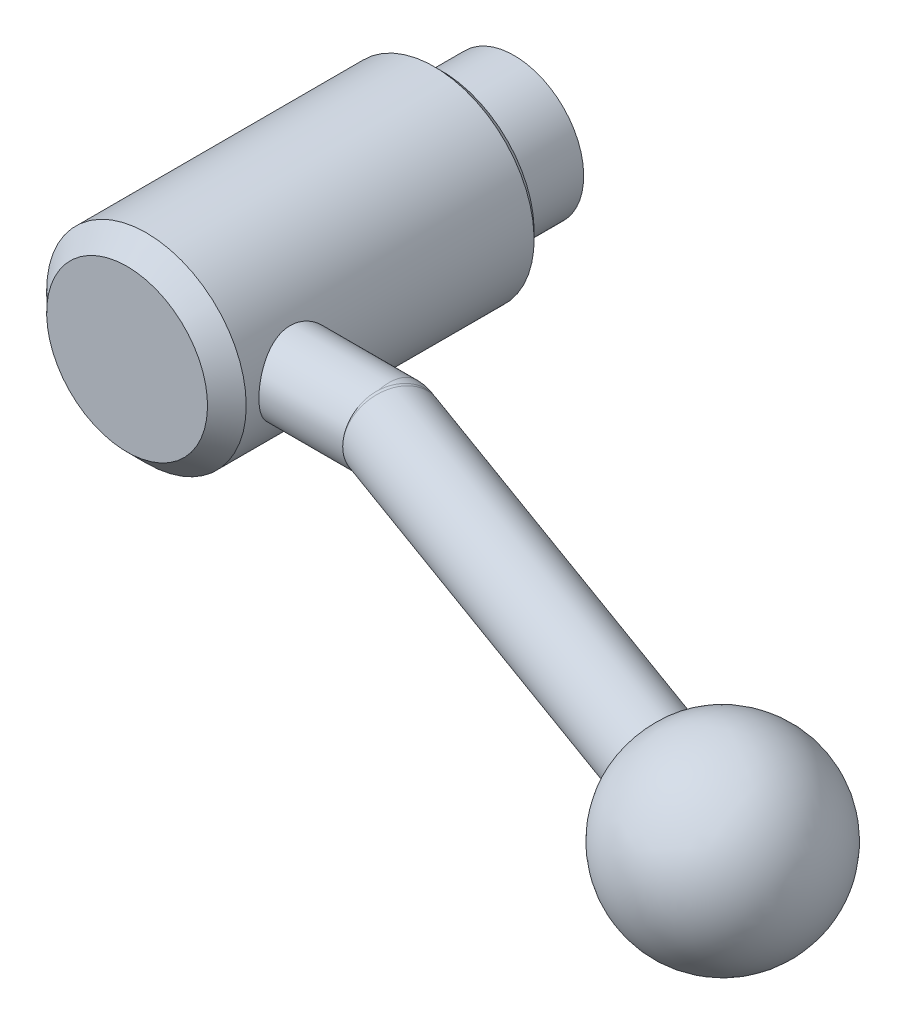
ISO-10303-21;
HEADER;
FILE_DESCRIPTION(('STEP AP214'),'2;1');
FILE_NAME('part.step','',(''),(''),'','','');
FILE_SCHEMA(('AUTOMOTIVE_DESIGN { 1 0 10303 214 1 1 1 1 }'));
ENDSEC;
DATA;
#1=APPLICATION_CONTEXT('core data for automotive mechanical design processes');
#2=APPLICATION_PROTOCOL_DEFINITION('international standard','automotive_design',2000,#1);
#3=PRODUCT_CONTEXT('',#1,'mechanical');
#4=PRODUCT('Part','Part','',(#3));
#5=PRODUCT_RELATED_PRODUCT_CATEGORY('part','',(#4));
#6=PRODUCT_DEFINITION_FORMATION('','',#4);
#7=PRODUCT_DEFINITION_CONTEXT('part definition',#1,'design');
#8=PRODUCT_DEFINITION('design','',#6,#7);
#9=PRODUCT_DEFINITION_SHAPE('','',#8);
#10=(LENGTH_UNIT() NAMED_UNIT(*) SI_UNIT(.MILLI.,.METRE.));
#11=(NAMED_UNIT(*) PLANE_ANGLE_UNIT() SI_UNIT($,.RADIAN.));
#12=(NAMED_UNIT(*) SI_UNIT($,.STERADIAN.) SOLID_ANGLE_UNIT());
#13=UNCERTAINTY_MEASURE_WITH_UNIT(LENGTH_MEASURE(1.E-05),#10,'distance_accuracy_value','');
#14=(GEOMETRIC_REPRESENTATION_CONTEXT(3) GLOBAL_UNCERTAINTY_ASSIGNED_CONTEXT((#13)) GLOBAL_UNIT_ASSIGNED_CONTEXT((#10,
#11,#12)) REPRESENTATION_CONTEXT('',''));
#15=CARTESIAN_POINT('',(0.,0.,0.));
#16=DIRECTION('',(0.,0.,1.));
#17=DIRECTION('',(1.,0.,0.));
#18=AXIS2_PLACEMENT_3D('',#15,#16,#17);
#19=CARTESIAN_POINT('',(5.75,0.,0.));
#20=DIRECTION('',(0.,0.,-1.));
#21=DIRECTION('',(0.,1.,0.));
#22=AXIS2_PLACEMENT_3D('',#19,#20,#21);
#23=PLANE('',#22);
#24=CARTESIAN_POINT('',(0.,0.,0.));
#25=DIRECTION('',(0.,0.,-1.));
#26=DIRECTION('',(-1.,0.,0.));
#27=AXIS2_PLACEMENT_3D('',#24,#25,#26);
#28=CIRCLE('',#27,9.);
#29=CARTESIAN_POINT('',(-9.,0.,0.));
#30=VERTEX_POINT('',#29);
#31=EDGE_CURVE('E9',#30,#30,#28,.F.);
#32=ORIENTED_EDGE('',*,*,#31,.T.);
#33=EDGE_LOOP('',(#32));
#34=FACE_BOUND('',#33,.T.);
#35=CARTESIAN_POINT('',(0.,0.,0.));
#36=DIRECTION('',(0.,0.,1.));
#37=DIRECTION('',(0.,-1.,0.));
#38=AXIS2_PLACEMENT_3D('',#35,#36,#37);
#39=CIRCLE('',#38,11.5);
#40=CARTESIAN_POINT('',(0.,-11.5,0.));
#41=VERTEX_POINT('',#40);
#42=EDGE_CURVE('E286',#41,#41,#39,.T.);
#43=ORIENTED_EDGE('',*,*,#42,.F.);
#44=EDGE_LOOP('',(#43));
#45=FACE_BOUND('',#44,.T.);
#46=ADVANCED_FACE('F14',(#34,#45),#23,.T.);
#47=CARTESIAN_POINT('',(0.,0.,6.));
#48=DIRECTION('',(0.,0.,1.));
#49=DIRECTION('',(0.,-1.,0.));
#50=AXIS2_PLACEMENT_3D('',#47,#48,#49);
#51=CYLINDRICAL_SURFACE('',#50,11.5);
#52=CARTESIAN_POINT('',(0.,0.,12.));
#53=DIRECTION('',(0.,0.,1.));
#54=DIRECTION('',(0.,-1.,0.));
#55=AXIS2_PLACEMENT_3D('',#52,#53,#54);
#56=CIRCLE('',#55,11.5);
#57=CARTESIAN_POINT('',(0.,-11.5,12.));
#58=VERTEX_POINT('',#57);
#59=EDGE_CURVE('E281',#58,#58,#56,.T.);
#60=ORIENTED_EDGE('',*,*,#59,.F.);
#61=EDGE_LOOP('',(#60));
#62=FACE_BOUND('',#61,.T.);
#63=ORIENTED_EDGE('',*,*,#42,.T.);
#64=EDGE_LOOP('',(#63));
#65=FACE_BOUND('',#64,.T.);
#66=ADVANCED_FACE('F175',(#62,#65),#51,.T.);
#67=CARTESIAN_POINT('',(13.4,0.,12.));
#68=DIRECTION('',(0.,0.,-1.));
#69=DIRECTION('',(0.,1.,0.));
#70=AXIS2_PLACEMENT_3D('',#67,#68,#69);
#71=PLANE('',#70);
#72=ORIENTED_EDGE('',*,*,#59,.T.);
#73=EDGE_LOOP('',(#72));
#74=FACE_BOUND('',#73,.T.);
#75=CARTESIAN_POINT('',(0.,0.,12.));
#76=DIRECTION('',(0.,0.,1.));
#77=DIRECTION('',(0.,-1.,0.));
#78=AXIS2_PLACEMENT_3D('',#75,#76,#77);
#79=CIRCLE('',#78,15.3);
#80=CARTESIAN_POINT('',(0.,-15.3,12.));
#81=VERTEX_POINT('',#80);
#82=EDGE_CURVE('E277',#81,#81,#79,.T.);
#83=ORIENTED_EDGE('',*,*,#82,.F.);
#84=EDGE_LOOP('',(#83));
#85=FACE_BOUND('',#84,.T.);
#86=ADVANCED_FACE('F185',(#74,#85),#71,.T.);
#87=CARTESIAN_POINT('',(6.65,0.,64.));
#88=DIRECTION('',(0.,0.,1.));
#89=DIRECTION('',(0.,-1.,0.));
#90=AXIS2_PLACEMENT_3D('',#87,#88,#89);
#91=PLANE('',#90);
#92=CARTESIAN_POINT('',(0.,0.,64.));
#93=DIRECTION('',(0.,0.,-1.));
#94=DIRECTION('',(0.,1.,0.));
#95=AXIS2_PLACEMENT_3D('',#92,#93,#94);
#96=CIRCLE('',#95,13.3);
#97=CARTESIAN_POINT('',(0.,13.3,64.));
#98=VERTEX_POINT('',#97);
#99=EDGE_CURVE('E274',#98,#98,#96,.T.);
#100=ORIENTED_EDGE('',*,*,#99,.F.);
#101=EDGE_LOOP('',(#100));
#102=FACE_BOUND('',#101,.T.);
#103=ADVANCED_FACE('F195',(#102),#91,.T.);
#104=CARTESIAN_POINT('',(0.,0.,13.2));
#105=DIRECTION('',(0.,0.,1.));
#106=DIRECTION('',(0.,-1.,0.));
#107=AXIS2_PLACEMENT_3D('',#104,#105,#106);
#108=CONICAL_SURFACE('',#107,16.5,0.785398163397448);
#109=ORIENTED_EDGE('',*,*,#82,.T.);
#110=EDGE_LOOP('',(#109));
#111=FACE_BOUND('',#110,.T.);
#112=CARTESIAN_POINT('',(0.,0.,13.2));
#113=DIRECTION('',(0.,0.,1.));
#114=DIRECTION('',(0.,-1.,0.));
#115=AXIS2_PLACEMENT_3D('',#112,#113,#114);
#116=CIRCLE('',#115,16.5);
#117=CARTESIAN_POINT('',(0.,-16.5,13.2));
#118=VERTEX_POINT('',#117);
#119=EDGE_CURVE('E107',#118,#118,#116,.T.);
#120=ORIENTED_EDGE('',*,*,#119,.F.);
#121=EDGE_LOOP('',(#120));
#122=FACE_BOUND('',#121,.T.);
#123=ADVANCED_FACE('F205',(#111,#122),#108,.T.);
#124=CARTESIAN_POINT('',(0.,0.,60.8));
#125=DIRECTION('',(0.,0.,-1.));
#126=DIRECTION('',(0.,1.,0.));
#127=AXIS2_PLACEMENT_3D('',#124,#125,#126);
#128=CONICAL_SURFACE('',#127,16.5,0.785398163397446);
#129=CARTESIAN_POINT('',(0.,0.,60.8));
#130=DIRECTION('',(0.,0.,1.));
#131=DIRECTION('',(0.,-1.,0.));
#132=AXIS2_PLACEMENT_3D('',#129,#130,#131);
#133=CIRCLE('',#132,16.5);
#134=CARTESIAN_POINT('',(0.,-16.5,60.8));
#135=VERTEX_POINT('',#134);
#136=EDGE_CURVE('E47',#135,#135,#133,.F.);
#137=ORIENTED_EDGE('',*,*,#136,.F.);
#138=EDGE_LOOP('',(#137));
#139=FACE_BOUND('',#138,.T.);
#140=ORIENTED_EDGE('',*,*,#99,.T.);
#141=EDGE_LOOP('',(#140));
#142=FACE_BOUND('',#141,.T.);
#143=ADVANCED_FACE('F215',(#139,#142),#128,.T.);
#144=CARTESIAN_POINT('',(0.,0.,37.));
#145=DIRECTION('',(0.,0.,1.));
#146=DIRECTION('',(0.,-1.,0.));
#147=AXIS2_PLACEMENT_3D('',#144,#145,#146);
#148=CYLINDRICAL_SURFACE('',#147,16.5);
#149=ORIENTED_EDGE('',*,*,#119,.T.);
#150=EDGE_LOOP('',(#149));
#151=FACE_BOUND('',#150,.T.);
#152=ORIENTED_EDGE('',*,*,#136,.T.);
#153=EDGE_LOOP('',(#152));
#154=FACE_BOUND('',#153,.T.);
#155=CARTESIAN_POINT('',(15.1657508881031,-6.5,52.2));
#156=CARTESIAN_POINT('',(15.165745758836,-6.50000508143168,52.0253356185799));
#157=CARTESIAN_POINT('',(15.1687745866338,-6.4929568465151,51.8507222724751));
#158=CARTESIAN_POINT('',(15.1807749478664,-6.46485327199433,51.5027802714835));
#159=CARTESIAN_POINT('',(15.1897474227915,-6.44379571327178,51.3294518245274));
#160=CARTESIAN_POINT('',(15.2133459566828,-6.38788044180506,50.9853414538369));
#161=CARTESIAN_POINT('',(15.2279750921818,-6.35301521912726,50.8145609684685));
#162=CARTESIAN_POINT('',(15.2624132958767,-6.26982978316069,50.4767762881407));
#163=CARTESIAN_POINT('',(15.2822244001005,-6.22150428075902,50.3097736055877));
#164=CARTESIAN_POINT('',(15.3263261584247,-6.1120529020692,49.9812888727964));
#165=CARTESIAN_POINT('',(15.3506010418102,-6.05097199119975,49.819789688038));
#166=CARTESIAN_POINT('',(15.4029664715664,-5.91640387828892,49.5026208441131));
#167=CARTESIAN_POINT('',(15.4310584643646,-5.84291197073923,49.3469534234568));
#168=CARTESIAN_POINT('',(15.4902542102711,-5.68411811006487,49.0424245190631));
#169=CARTESIAN_POINT('',(15.5213571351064,-5.59881940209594,48.8935611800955));
#170=CARTESIAN_POINT('',(15.5857641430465,-5.41694229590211,48.6033239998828));
#171=CARTESIAN_POINT('',(15.6190690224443,-5.32035980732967,48.4619529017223));
#172=CARTESIAN_POINT('',(15.6887193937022,-5.11143835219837,48.1806209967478));
#173=CARTESIAN_POINT('',(15.725133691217,-4.99855381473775,48.04108210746));
#174=CARTESIAN_POINT('',(15.7984639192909,-4.76171225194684,47.7718807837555));
#175=CARTESIAN_POINT('',(15.8353798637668,-4.63775491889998,47.6422186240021));
#176=CARTESIAN_POINT('',(15.9087667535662,-4.37940403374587,47.3934424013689));
#177=CARTESIAN_POINT('',(15.9452374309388,-4.24500452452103,47.2743344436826));
#178=CARTESIAN_POINT('',(16.0167560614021,-3.96663185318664,47.0475194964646));
#179=CARTESIAN_POINT('',(16.0518045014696,-3.82266201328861,46.9398085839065));
#180=CARTESIAN_POINT('',(16.1209091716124,-3.52012556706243,46.7324927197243));
#181=CARTESIAN_POINT('',(16.1548735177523,-3.3612087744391,46.6333671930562));
#182=CARTESIAN_POINT('',(16.219333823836,-3.03493842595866,46.4489784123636));
#183=CARTESIAN_POINT('',(16.2498311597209,-2.86758825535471,46.3637096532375));
#184=CARTESIAN_POINT('',(16.3064735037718,-2.52565072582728,46.2078089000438));
#185=CARTESIAN_POINT('',(16.3326221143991,-2.35106950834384,46.1371647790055));
#186=CARTESIAN_POINT('',(16.3798219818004,-1.99588359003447,46.0111415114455));
#187=CARTESIAN_POINT('',(16.4008745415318,-1.81528044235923,45.9557584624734));
#188=CARTESIAN_POINT('',(16.4454357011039,-1.36695920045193,45.8394592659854));
#189=CARTESIAN_POINT('',(16.4657881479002,-1.09660341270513,45.7872635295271));
#190=CARTESIAN_POINT('',(16.4930664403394,-0.550789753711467,45.7175398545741));
#191=CARTESIAN_POINT('',(16.4999939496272,-0.27533251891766,45.700007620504));
#192=CARTESIAN_POINT('',(16.5000038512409,0.175257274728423,45.6999951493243));
#193=CARTESIAN_POINT('',(16.4972033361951,0.350464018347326,45.7070907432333));
#194=CARTESIAN_POINT('',(16.4860855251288,0.699610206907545,45.7353885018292));
#195=CARTESIAN_POINT('',(16.4777673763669,0.873549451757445,45.7565928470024));
#196=CARTESIAN_POINT('',(16.4558274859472,1.21889636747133,45.8129094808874));
#197=CARTESIAN_POINT('',(16.4422032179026,1.39030279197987,45.8480283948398));
#198=CARTESIAN_POINT('',(16.4100071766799,1.72935619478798,45.9318397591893));
#199=CARTESIAN_POINT('',(16.3914335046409,1.8970017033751,45.9805374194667));
#200=CARTESIAN_POINT('',(16.3498830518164,2.22685454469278,46.0908856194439));
#201=CARTESIAN_POINT('',(16.3269192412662,2.38907628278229,46.1524980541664));
#202=CARTESIAN_POINT('',(16.2771221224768,2.70763704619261,46.2882581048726));
#203=CARTESIAN_POINT('',(16.2502873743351,2.86397385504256,46.3624103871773));
#204=CARTESIAN_POINT('',(16.1934219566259,3.1697418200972,46.5226308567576));
#205=CARTESIAN_POINT('',(16.1633922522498,3.31917504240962,46.6086954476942));
#206=CARTESIAN_POINT('',(16.1008405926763,3.61041938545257,46.792180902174));
#207=CARTESIAN_POINT('',(16.0683177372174,3.752227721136,46.8896058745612));
#208=CARTESIAN_POINT('',(16.0001727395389,4.03314016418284,47.0994336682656));
#209=CARTESIAN_POINT('',(15.9644779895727,4.17188782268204,47.2122902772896));
#210=CARTESIAN_POINT('',(15.892142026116,4.4394861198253,47.44890903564));
#211=CARTESIAN_POINT('',(15.8555007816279,4.56833643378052,47.5726715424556));
#212=CARTESIAN_POINT('',(15.78219693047,4.81548386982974,47.83044474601));
#213=CARTESIAN_POINT('',(15.7455343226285,4.93377545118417,47.9644607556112));
#214=CARTESIAN_POINT('',(15.6731846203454,5.15899919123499,48.2418892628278));
#215=CARTESIAN_POINT('',(15.6374972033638,5.26593514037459,48.3852985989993));
#216=CARTESIAN_POINT('',(15.5665464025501,5.4722064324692,48.6871932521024));
#217=CARTESIAN_POINT('',(15.5313687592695,5.57100992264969,48.8460628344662));
#218=CARTESIAN_POINT('',(15.4642240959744,5.75476702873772,49.1721837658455));
#219=CARTESIAN_POINT('',(15.4322557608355,5.83972632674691,49.3394316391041));
#220=CARTESIAN_POINT('',(15.3725571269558,5.99511642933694,49.6813028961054));
#221=CARTESIAN_POINT('',(15.3448272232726,6.06554587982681,49.8559269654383));
#222=CARTESIAN_POINT('',(15.2945852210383,6.19114229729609,50.211222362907));
#223=CARTESIAN_POINT('',(15.2720705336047,6.24631683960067,50.3918906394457));
#224=CARTESIAN_POINT('',(15.2339240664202,6.33876553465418,50.7499242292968));
#225=CARTESIAN_POINT('',(15.2180336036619,6.37671895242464,50.9270865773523));
#226=CARTESIAN_POINT('',(15.1923255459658,6.43772822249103,51.2843194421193));
#227=CARTESIAN_POINT('',(15.1825052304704,6.4607907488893,51.4643886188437));
#228=CARTESIAN_POINT('',(15.1692851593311,6.49176962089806,51.8260259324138));
#229=CARTESIAN_POINT('',(15.1658841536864,6.49968891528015,52.007593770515));
#230=CARTESIAN_POINT('',(15.1656253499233,6.50029305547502,52.3707553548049));
#231=CARTESIAN_POINT('',(15.1687672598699,6.49297858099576,52.5523490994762));
#232=CARTESIAN_POINT('',(15.1810465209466,6.4642126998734,52.9018533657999));
#233=CARTESIAN_POINT('',(15.1897653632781,6.44374768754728,53.069860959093));
#234=CARTESIAN_POINT('',(15.2125161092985,6.38985201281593,53.4034742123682));
#235=CARTESIAN_POINT('',(15.2265497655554,6.35641707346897,53.5690790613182));
#236=CARTESIAN_POINT('',(15.2594944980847,6.27691602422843,53.8966826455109));
#237=CARTESIAN_POINT('',(15.2784043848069,6.2308529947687,54.058682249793));
#238=CARTESIAN_POINT('',(15.3205529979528,6.12648519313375,54.3781720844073));
#239=CARTESIAN_POINT('',(15.3437933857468,6.06817572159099,54.5356605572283));
#240=CARTESIAN_POINT('',(15.3944388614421,5.93853407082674,54.8482065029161));
#241=CARTESIAN_POINT('',(15.4219169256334,5.86696813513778,55.003155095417));
#242=CARTESIAN_POINT('',(15.4799371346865,5.71212576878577,55.306547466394));
#243=CARTESIAN_POINT('',(15.5104803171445,5.62884536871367,55.4549890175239));
#244=CARTESIAN_POINT('',(15.573821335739,5.45114518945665,55.7445557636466));
#245=CARTESIAN_POINT('',(15.6066193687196,5.35672443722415,55.8856803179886));
#246=CARTESIAN_POINT('',(15.6736444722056,5.15731826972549,56.1599004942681));
#247=CARTESIAN_POINT('',(15.7078716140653,5.05233232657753,56.292995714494));
#248=CARTESIAN_POINT('',(15.779514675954,4.82413356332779,56.5601446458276));
#249=CARTESIAN_POINT('',(15.8169774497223,4.70014455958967,56.6935237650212));
#250=CARTESIAN_POINT('',(15.8915700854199,4.44140964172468,56.9494187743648));
#251=CARTESIAN_POINT('',(15.9287000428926,4.30666693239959,57.071937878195));
#252=CARTESIAN_POINT('',(16.0016814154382,4.0270441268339,57.3054996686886));
#253=CARTESIAN_POINT('',(16.0375317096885,3.88215545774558,57.4165324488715));
#254=CARTESIAN_POINT('',(16.106952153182,3.58324186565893,57.6262041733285));
#255=CARTESIAN_POINT('',(16.1405232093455,3.42922062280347,57.7248480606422));
#256=CARTESIAN_POINT('',(16.20513395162,3.10977568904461,57.9108780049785));
#257=CARTESIAN_POINT('',(16.2361103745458,2.94418663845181,57.9980025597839));
#258=CARTESIAN_POINT('',(16.293877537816,2.60557789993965,58.1578518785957));
#259=CARTESIAN_POINT('',(16.3206700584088,2.43256141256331,58.2305827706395));
#260=CARTESIAN_POINT('',(16.3692672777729,2.08053032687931,58.3608897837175));
#261=CARTESIAN_POINT('',(16.3910795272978,1.90152528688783,58.4184888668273));
#262=CARTESIAN_POINT('',(16.4291085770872,1.53871493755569,58.5180476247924));
#263=CARTESIAN_POINT('',(16.4453277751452,1.35491172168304,58.5600140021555));
#264=CARTESIAN_POINT('',(16.4721817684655,0.976957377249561,58.6291390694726));
#265=CARTESIAN_POINT('',(16.4825841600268,0.7826767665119,58.6556829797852));
#266=CARTESIAN_POINT('',(16.4964929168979,0.392259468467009,58.691112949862));
#267=CARTESIAN_POINT('',(16.4999993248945,0.19612279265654,58.6999991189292));
#268=CARTESIAN_POINT('',(16.5000006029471,-0.175160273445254,58.7000007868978));
#269=CARTESIAN_POINT('',(16.4972048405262,-0.350309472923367,58.6929141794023));
#270=CARTESIAN_POINT('',(16.4860972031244,-0.699350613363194,58.6646401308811));
#271=CARTESIAN_POINT('',(16.4777835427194,-0.873242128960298,58.6434481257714));
#272=CARTESIAN_POINT('',(16.4558494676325,-1.21860319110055,58.5871474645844));
#273=CARTESIAN_POINT('',(16.4422234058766,-1.39006995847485,58.5520239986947));
#274=CARTESIAN_POINT('',(16.4100199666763,-1.72924172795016,58.4681936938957));
#275=CARTESIAN_POINT('',(16.3914406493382,-1.89694522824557,58.4194815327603));
#276=CARTESIAN_POINT('',(16.3498814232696,-2.22686723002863,58.3091100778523));
#277=CARTESIAN_POINT('',(16.3269156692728,-2.38910145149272,58.2474923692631));
#278=CARTESIAN_POINT('',(16.2771139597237,-2.70768694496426,58.1117194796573));
#279=CARTESIAN_POINT('',(16.250276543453,-2.86403596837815,58.037559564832));
#280=CARTESIAN_POINT('',(16.1934100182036,-3.16980213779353,57.8773350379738));
#281=CARTESIAN_POINT('',(16.1633823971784,-3.31922246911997,57.7912759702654));
#282=CARTESIAN_POINT('',(16.100835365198,-3.61044218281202,57.6078034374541));
#283=CARTESIAN_POINT('',(16.0683150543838,-3.75223878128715,57.5103858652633));
#284=CARTESIAN_POINT('',(16.0001757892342,-4.03312759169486,57.300575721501));
#285=CARTESIAN_POINT('',(15.9644842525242,-4.17186347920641,57.1877295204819));
#286=CARTESIAN_POINT('',(15.8921547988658,-4.43944004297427,56.9511334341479));
#287=CARTESIAN_POINT('',(15.8555168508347,-4.56828039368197,56.8273831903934));
#288=CARTESIAN_POINT('',(15.7822130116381,-4.81543151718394,56.5696135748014));
#289=CARTESIAN_POINT('',(15.7455471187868,-4.93373489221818,56.4355871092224));
#290=CARTESIAN_POINT('',(15.673190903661,-5.15898035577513,56.1581360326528));
#291=CARTESIAN_POINT('',(15.6375002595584,-5.26592622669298,56.0147145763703));
#292=CARTESIAN_POINT('',(15.5665307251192,-5.47225204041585,55.7127398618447));
#293=CARTESIAN_POINT('',(15.5313383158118,-5.57109554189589,55.5537989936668));
#294=CARTESIAN_POINT('',(15.4641668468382,-5.75492139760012,55.2275284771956));
#295=CARTESIAN_POINT('',(15.4321865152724,-5.83990924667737,55.0602021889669));
#296=CARTESIAN_POINT('',(15.3724986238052,-5.9952660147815,54.7183316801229));
#297=CARTESIAN_POINT('',(15.3447872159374,-6.06564811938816,54.5437941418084));
#298=CARTESIAN_POINT('',(15.2945703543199,-6.191177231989,54.1886684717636));
#299=CARTESIAN_POINT('',(15.2720634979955,-6.24632834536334,54.0080819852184));
#300=CARTESIAN_POINT('',(15.2244373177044,-6.36176485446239,53.5609796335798));
#301=CARTESIAN_POINT('',(15.2025795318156,-6.41349655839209,53.2918451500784));
#302=CARTESIAN_POINT('',(15.1732415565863,-6.48260724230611,52.7484312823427));
#303=CARTESIAN_POINT('',(15.1657589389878,-6.49999202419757,52.474152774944));
#304=CARTESIAN_POINT('',(15.1657508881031,-6.5,52.2));
#305=B_SPLINE_CURVE_WITH_KNOTS('',3,(#155,#156,#157,#158,#159,#160,#161,#162,#163,#164,#165,
#166,#167,#168,#169,#170,#171,#172,#173,#174,#175,#176,#177,#178,#179,#180,#181,#182,#183,#184,
#185,#186,#187,#188,#189,#190,#191,#192,#193,#194,#195,#196,#197,#198,#199,#200,#201,#202,#203,
#204,#205,#206,#207,#208,#209,#210,#211,#212,#213,#214,#215,#216,#217,#218,#219,#220,#221,#222,
#223,#224,#225,#226,#227,#228,#229,#230,#231,#232,#233,#234,#235,#236,#237,#238,#239,#240,#241,
#242,#243,#244,#245,#246,#247,#248,#249,#250,#251,#252,#253,#254,#255,#256,#257,#258,#259,#260,
#261,#262,#263,#264,#265,#266,#267,#268,#269,#270,#271,#272,#273,#274,#275,#276,#277,#278,#279,
#280,#281,#282,#283,#284,#285,#286,#287,#288,#289,#290,#291,#292,#293,#294,#295,#296,#297,#298,
#299,#300,#301,#302,#303,#304),.UNSPECIFIED.,.T.,.F.,(4,2,2,2,2,2,2,2,2,2,2,2,2,2,2,2,2,2,2,2,2,
2,2,2,2,2,2,2,2,2,2,2,2,2,2,2,2,2,2,2,2,2,2,2,2,2,2,2,2,2,2,2,2,2,2,2,2,2,2,2,2,2,2,2,2,2,2,2,2,
2,2,2,2,2,4),(0.,0.523737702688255,1.04755838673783,1.57166436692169,2.09597658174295,
2.61847078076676,3.14116352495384,3.66371288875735,4.1864522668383,4.73526045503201,
5.28408389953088,5.83322277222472,6.38217200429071,6.95251243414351,7.5226257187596,
8.09226434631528,8.66175717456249,9.48746056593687,10.3130616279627,10.8385810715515,
11.3641817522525,11.890032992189,12.4160862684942,12.9406087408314,13.4653268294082,
13.9898868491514,14.5146371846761,15.0611644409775,15.6077096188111,16.1545399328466,
16.7011871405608,17.2715771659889,17.8417324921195,18.4119409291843,18.9818656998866,
19.5267807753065,20.0714514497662,20.6160160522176,21.1605563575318,21.6683825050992,
22.1763762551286,22.6842461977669,23.1923113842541,23.7103778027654,24.228620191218,
24.7469078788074,25.2652214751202,25.8223490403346,26.3793111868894,26.9367497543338,
27.4939651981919,28.0622107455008,28.6302138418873,29.1973499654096,29.7642426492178,
30.352408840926,30.9405713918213,31.4658683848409,31.991335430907,32.5173625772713,
33.0435960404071,33.5681592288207,34.0929208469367,34.6174387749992,35.1421469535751,
35.6886262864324,36.2351235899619,36.7820016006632,37.3286969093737,37.8993337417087,
38.4697437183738,39.0396364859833,39.6093754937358,40.4315717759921,41.2536291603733),.UNSPECIFIED.);
#306=CARTESIAN_POINT('',(15.1657508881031,-6.5,52.2));
#307=VERTEX_POINT('',#306);
#308=EDGE_CURVE('E46',#307,#307,#305,.T.);
#309=ORIENTED_EDGE('',*,*,#308,.F.);
#310=EDGE_LOOP('',(#309));
#311=FACE_BOUND('',#310,.T.);
#312=ADVANCED_FACE('F225',(#151,#154,#311),#148,.T.);
#313=CARTESIAN_POINT('',(31.5,0.,52.2));
#314=DIRECTION('',(1.,0.,0.));
#315=DIRECTION('',(0.,0.,1.));
#316=AXIS2_PLACEMENT_3D('',#313,#314,#315);
#317=SPHERICAL_SURFACE('',#316,6.5);
#318=CARTESIAN_POINT('',(31.5,0.,52.2));
#319=DIRECTION('',(-1.,0.,0.));
#320=DIRECTION('',(0.,-1.,0.));
#321=AXIS2_PLACEMENT_3D('',#318,#319,#320);
#322=CIRCLE('',#321,6.5);
#323=CARTESIAN_POINT('',(31.5,6.28033613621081,53.8755232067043));
#324=VERTEX_POINT('',#323);
#325=CARTESIAN_POINT('',(31.5,-6.28033613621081,53.8755232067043));
#326=VERTEX_POINT('',#325);
#327=EDGE_CURVE('E35',#324,#326,#322,.T.);
#328=ORIENTED_EDGE('',*,*,#327,.F.);
#329=CARTESIAN_POINT('',(31.5,-6.28033613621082,53.8755232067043));
#330=CARTESIAN_POINT('',(31.5604115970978,-6.32463778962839,53.7095437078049));
#331=CARTESIAN_POINT('',(31.6214644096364,-6.3614496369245,53.5418024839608));
#332=CARTESIAN_POINT('',(31.7444103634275,-6.41991545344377,53.2040112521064));
#333=CARTESIAN_POINT('',(31.8063034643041,-6.44157014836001,53.033961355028));
#334=CARTESIAN_POINT('',(31.9304500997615,-6.46953783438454,52.6928712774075));
#335=CARTESIAN_POINT('',(31.9927033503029,-6.4758616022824,52.5218318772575));
#336=CARTESIAN_POINT('',(32.1171700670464,-6.47316004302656,52.1798623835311));
#337=CARTESIAN_POINT('',(32.1793835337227,-6.46413490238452,52.0089322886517));
#338=CARTESIAN_POINT('',(32.3033473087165,-6.43079358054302,51.6683446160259));
#339=CARTESIAN_POINT('',(32.3650974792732,-6.40647302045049,51.498687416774));
#340=CARTESIAN_POINT('',(32.4877003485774,-6.342698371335,51.1618388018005));
#341=CARTESIAN_POINT('',(32.5485527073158,-6.30323869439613,50.994648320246));
#342=CARTESIAN_POINT('',(32.6688696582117,-6.20949357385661,50.664080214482));
#343=CARTESIAN_POINT('',(32.728335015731,-6.15521652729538,50.5007004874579));
#344=CARTESIAN_POINT('',(32.8455127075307,-6.03218986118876,50.1787574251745));
#345=CARTESIAN_POINT('',(32.9032243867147,-5.96343490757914,50.0201958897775));
#346=CARTESIAN_POINT('',(33.0164417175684,-5.8119796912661,49.709133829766));
#347=CARTESIAN_POINT('',(33.0719481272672,-5.72928427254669,49.5566312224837));
#348=CARTESIAN_POINT('',(33.1804017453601,-5.55048605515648,49.2586573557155));
#349=CARTESIAN_POINT('',(33.2333480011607,-5.45437831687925,49.1131887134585));
#350=CARTESIAN_POINT('',(33.3362716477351,-5.24948436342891,48.8304083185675));
#351=CARTESIAN_POINT('',(33.3862496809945,-5.14070090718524,48.6930948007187));
#352=CARTESIAN_POINT('',(33.4829120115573,-4.91116949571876,48.4275172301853));
#353=CARTESIAN_POINT('',(33.5295950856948,-4.79041713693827,48.2992565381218));
#354=CARTESIAN_POINT('',(33.6192965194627,-4.53789283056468,48.0528038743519));
#355=CARTESIAN_POINT('',(33.6623163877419,-4.40612546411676,47.9346077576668));
#356=CARTESIAN_POINT('',(33.7444224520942,-4.13241387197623,47.7090231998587));
#357=CARTESIAN_POINT('',(33.7835071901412,-3.9904659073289,47.601638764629));
#358=CARTESIAN_POINT('',(33.8574309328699,-3.69750906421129,47.3985349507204));
#359=CARTESIAN_POINT('',(33.8922717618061,-3.54650412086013,47.3028105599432));
#360=CARTESIAN_POINT('',(33.957491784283,-3.23639397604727,47.1236200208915));
#361=CARTESIAN_POINT('',(33.9878693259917,-3.07728580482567,47.0401584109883));
#362=CARTESIAN_POINT('',(34.0439215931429,-2.75220747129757,46.8861560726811));
#363=CARTESIAN_POINT('',(34.0695979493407,-2.58623971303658,46.8156108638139));
#364=CARTESIAN_POINT('',(34.1160870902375,-2.2485120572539,46.6878829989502));
#365=CARTESIAN_POINT('',(34.1368980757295,-2.07675004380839,46.6307052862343));
#366=CARTESIAN_POINT('',(34.1734894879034,-1.72875737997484,46.5301712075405));
#367=CARTESIAN_POINT('',(34.1892716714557,-1.55252831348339,46.4868100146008));
#368=CARTESIAN_POINT('',(34.215709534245,-1.19679469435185,46.4141725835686));
#369=CARTESIAN_POINT('',(34.2263633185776,-1.01728895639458,46.384901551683));
#370=CARTESIAN_POINT('',(34.2504829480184,-0.475899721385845,46.3186334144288));
#371=CARTESIAN_POINT('',(34.2561470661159,-0.110762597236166,46.3030713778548));
#372=CARTESIAN_POINT('',(34.2464222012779,0.616910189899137,46.3297902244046));
#373=CARTESIAN_POINT('',(34.2310332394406,0.979445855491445,46.3720710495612));
#374=CARTESIAN_POINT('',(34.1796583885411,1.69187342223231,46.5132222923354));
#375=CARTESIAN_POINT('',(34.1436723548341,2.04176523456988,46.6120931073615));
#376=CARTESIAN_POINT('',(34.0521201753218,2.71889949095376,46.8636306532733));
#377=CARTESIAN_POINT('',(33.9965542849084,3.0461422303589,47.0162966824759));
#378=CARTESIAN_POINT('',(33.8674217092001,3.66870864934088,47.3710855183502));
#379=CARTESIAN_POINT('',(33.7938552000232,3.96403264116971,47.5732078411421));
#380=CARTESIAN_POINT('',(33.6308061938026,4.51438637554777,48.0211813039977));
#381=CARTESIAN_POINT('',(33.541323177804,4.76941480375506,48.2670338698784));
#382=CARTESIAN_POINT('',(33.3489838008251,5.23192699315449,48.7954819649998));
#383=CARTESIAN_POINT('',(33.2461274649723,5.43941084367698,49.0780774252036));
#384=CARTESIAN_POINT('',(33.0299624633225,5.80093835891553,49.6719858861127));
#385=CARTESIAN_POINT('',(32.9166540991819,5.95498356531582,49.983298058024));
#386=CARTESIAN_POINT('',(32.6827891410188,6.20528929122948,50.625836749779));
#387=CARTESIAN_POINT('',(32.5622315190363,6.30154159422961,50.9570660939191));
#388=CARTESIAN_POINT('',(32.3173112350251,6.43346974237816,51.6299790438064));
#389=CARTESIAN_POINT('',(32.1929495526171,6.4691610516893,51.9716599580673));
#390=CARTESIAN_POINT('',(31.9727599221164,6.47789082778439,52.5766259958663));
#391=CARTESIAN_POINT('',(31.876974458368,6.46349392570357,52.8397943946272));
#392=CARTESIAN_POINT('',(31.7344650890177,6.41489914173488,53.2313356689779));
#393=CARTESIAN_POINT('',(31.6871697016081,6.39421043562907,53.3612786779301));
#394=CARTESIAN_POINT('',(31.5931272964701,6.34392911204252,53.6196580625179));
#395=CARTESIAN_POINT('',(31.5463803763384,6.31433493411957,53.7480941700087));
#396=CARTESIAN_POINT('',(31.5,6.28033613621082,53.8755232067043));
#397=B_SPLINE_CURVE_WITH_KNOTS('',3,(#329,#330,#331,#332,#333,#334,#335,#336,#337,#338,#339,
#340,#341,#342,#343,#344,#345,#346,#347,#348,#349,#350,#351,#352,#353,#354,#355,#356,#357,#358,
#359,#360,#361,#362,#363,#364,#365,#366,#367,#368,#369,#370,#371,#372,#373,#374,#375,#376,#377,
#378,#379,#380,#381,#382,#383,#384,#385,#386,#387,#388,#389,#390,#391,#392,#393,#394,#395,#396),
.UNSPECIFIED.,.F.,.F.,(4,2,2,2,2,2,2,2,2,2,2,2,2,2,2,2,2,2,2,2,2,2,2,2,2,2,2,2,2,2,2,2,2,4),(0.,
0.546141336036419,1.09225652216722,1.63798770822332,2.18371226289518,2.72959312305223,
3.27567566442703,3.82144937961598,4.3674245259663,4.91321034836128,5.45919771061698,
6.00506645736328,6.55113678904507,7.0969811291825,7.64302697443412,8.18883726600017,
8.73484905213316,9.28067107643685,9.82669462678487,10.3725272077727,10.918561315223,
12.0094472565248,13.100332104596,14.1912246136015,15.2821028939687,16.3729705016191,
17.4638736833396,18.5547748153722,19.645644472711,20.7366691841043,21.827415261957,
22.6662852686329,23.0854882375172,23.5047647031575),.UNSPECIFIED.);
#398=EDGE_CURVE('E49',#326,#324,#397,.T.);
#399=ORIENTED_EDGE('',*,*,#398,.F.);
#400=EDGE_LOOP('',(#328,#399));
#401=FACE_BOUND('',#400,.T.);
#402=ADVANCED_FACE('F50',(#401),#317,.T.);
#403=CARTESIAN_POINT('',(15.75,0.,52.2));
#404=DIRECTION('',(-1.,0.,0.));
#405=DIRECTION('',(0.,-1.,0.));
#406=AXIS2_PLACEMENT_3D('',#403,#404,#405);
#407=CYLINDRICAL_SURFACE('',#406,6.5);
#408=CARTESIAN_POINT('',(30.353874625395,0.,58.7));
#409=CARTESIAN_POINT('',(30.3538760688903,-0.180413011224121,58.7000209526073));
#410=CARTESIAN_POINT('',(30.3551991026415,-0.360822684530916,58.6924896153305));
#411=CARTESIAN_POINT('',(30.3604984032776,-0.720343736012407,58.6624738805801));
#412=CARTESIAN_POINT('',(30.3644745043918,-0.899455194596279,58.6399904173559));
#413=CARTESIAN_POINT('',(30.3750867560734,-1.25500271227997,58.5802401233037));
#414=CARTESIAN_POINT('',(30.3817212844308,-1.43144033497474,58.5429823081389));
#415=CARTESIAN_POINT('',(30.3976715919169,-1.78049689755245,58.4539799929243));
#416=CARTESIAN_POINT('',(30.4069873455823,-1.95311587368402,58.4022356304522));
#417=CARTESIAN_POINT('',(30.42833245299,-2.29333224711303,58.2846548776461));
#418=CARTESIAN_POINT('',(30.4403620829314,-2.4609291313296,58.2188170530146));
#419=CARTESIAN_POINT('',(30.4671848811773,-2.78997750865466,58.073532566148));
#420=CARTESIAN_POINT('',(30.481979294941,-2.95142619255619,57.9940797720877));
#421=CARTESIAN_POINT('',(30.5143835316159,-3.26691386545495,57.8222351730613));
#422=CARTESIAN_POINT('',(30.5319923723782,-3.42095541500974,57.7298478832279));
#423=CARTESIAN_POINT('',(30.5701035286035,-3.72055534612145,57.5328784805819));
#424=CARTESIAN_POINT('',(30.5906045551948,-3.86611746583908,57.4283018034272));
#425=CARTESIAN_POINT('',(30.6347023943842,-4.14837693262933,57.2073163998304));
#426=CARTESIAN_POINT('',(30.6583107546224,-4.28503822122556,57.0908639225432));
#427=CARTESIAN_POINT('',(30.7087165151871,-4.5479574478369,56.8473847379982));
#428=CARTESIAN_POINT('',(30.7355139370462,-4.67421531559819,56.7203579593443));
#429=CARTESIAN_POINT('',(30.7925196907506,-4.9155279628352,56.4567044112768));
#430=CARTESIAN_POINT('',(30.8227291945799,-5.03057886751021,56.320074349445));
#431=CARTESIAN_POINT('',(30.8868489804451,-5.24868401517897,56.0383648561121));
#432=CARTESIAN_POINT('',(30.9207592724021,-5.35173822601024,55.8932854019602));
#433=CARTESIAN_POINT('',(30.991944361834,-5.54315969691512,55.5990494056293));
#434=CARTESIAN_POINT('',(31.0291330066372,-5.6317911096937,55.4500436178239));
#435=CARTESIAN_POINT('',(31.1080482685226,-5.79644456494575,55.1463609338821));
#436=CARTESIAN_POINT('',(31.1497744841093,-5.87246772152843,54.9916845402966));
#437=CARTESIAN_POINT('',(31.2164453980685,-5.97675614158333,54.7565126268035));
#438=CARTESIAN_POINT('',(31.2393571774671,-6.00990348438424,54.6775703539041));
#439=CARTESIAN_POINT('',(31.2867125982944,-6.07291452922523,54.5188354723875));
#440=CARTESIAN_POINT('',(31.311156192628,-6.10277833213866,54.4390428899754));
#441=CARTESIAN_POINT('',(31.361785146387,-6.15920167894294,54.2788091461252));
#442=CARTESIAN_POINT('',(31.3879711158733,-6.18576005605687,54.1983677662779));
#443=CARTESIAN_POINT('',(31.4423816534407,-6.23554888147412,54.0371353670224));
#444=CARTESIAN_POINT('',(31.4706064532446,-6.25877895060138,53.9563443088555));
#445=CARTESIAN_POINT('',(31.5,-6.28033613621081,53.8755232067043));
#446=B_SPLINE_CURVE_WITH_KNOTS('',3,(#408,#409,#410,#411,#412,#413,#414,#415,#416,#417,#418,
#419,#420,#421,#422,#423,#424,#425,#426,#427,#428,#429,#430,#431,#432,#433,#434,#435,#436,#437,
#438,#439,#440,#441,#442,#443,#444,#445),.UNSPECIFIED.,.F.,.F.,(4,2,2,2,2,2,2,2,2,2,2,2,2,2,2,2,
2,2,4),(0.,0.541072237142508,1.0821106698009,1.62281945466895,2.1635231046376,2.70428180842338,
3.2452846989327,3.78609920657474,4.32667346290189,4.86931655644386,5.41196331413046,
5.95479703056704,6.49763220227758,7.02900626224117,7.56033334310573,7.82616473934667,
8.09198796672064,8.35790476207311,8.62385182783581),.UNSPECIFIED.);
#447=CARTESIAN_POINT('',(30.3538746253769,0.,58.7));
#448=VERTEX_POINT('',#447);
#449=EDGE_CURVE('E42',#448,#326,#446,.T.);
#450=ORIENTED_EDGE('',*,*,#449,.F.);
#451=CARTESIAN_POINT('',(31.5,6.28033613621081,53.8755232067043));
#452=CARTESIAN_POINT('',(31.4799917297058,6.26566740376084,53.9305088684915));
#453=CARTESIAN_POINT('',(31.4605350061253,6.25022638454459,53.9854833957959));
#454=CARTESIAN_POINT('',(31.422614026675,6.21780122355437,54.0953164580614));
#455=CARTESIAN_POINT('',(31.404149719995,6.20081716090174,54.1501749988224));
#456=CARTESIAN_POINT('',(31.3500957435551,6.14756914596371,54.3143861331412));
#457=CARTESIAN_POINT('',(31.315823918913,6.10899372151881,54.4234330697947));
#458=CARTESIAN_POINT('',(31.2502052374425,6.02574752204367,54.6400479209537));
#459=CARTESIAN_POINT('',(31.2188581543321,5.98107721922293,54.7476159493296));
#460=CARTESIAN_POINT('',(31.1586887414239,5.88575616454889,54.9607044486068));
#461=CARTESIAN_POINT('',(31.129864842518,5.83510917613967,55.0662261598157));
#462=CARTESIAN_POINT('',(31.0744189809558,5.72792472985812,55.2748382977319));
#463=CARTESIAN_POINT('',(31.0477971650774,5.6713868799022,55.3779285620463));
#464=CARTESIAN_POINT('',(30.9965376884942,5.5525695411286,55.5812483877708));
#465=CARTESIAN_POINT('',(30.9719000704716,5.49028992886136,55.6814778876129));
#466=CARTESIAN_POINT('',(30.9126002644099,5.32768915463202,55.9278762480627));
#467=CARTESIAN_POINT('',(30.8790640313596,5.2238820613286,56.0720360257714));
#468=CARTESIAN_POINT('',(30.8156523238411,5.00438458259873,56.3518384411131));
#469=CARTESIAN_POINT('',(30.7857767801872,4.88869442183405,56.4874812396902));
#470=CARTESIAN_POINT('',(30.7294047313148,4.64620709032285,56.7491274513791));
#471=CARTESIAN_POINT('',(30.7029071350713,4.51941352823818,56.8751339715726));
#472=CARTESIAN_POINT('',(30.6530744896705,4.25553131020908,57.1165469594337));
#473=CARTESIAN_POINT('',(30.6297394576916,4.11844259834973,57.2319533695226));
#474=CARTESIAN_POINT('',(30.5858558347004,3.83342873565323,57.4523913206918));
#475=CARTESIAN_POINT('',(30.5653385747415,3.68540613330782,57.5573031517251));
#476=CARTESIAN_POINT('',(30.5272570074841,3.38076547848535,57.7545811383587));
#477=CARTESIAN_POINT('',(30.5096940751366,3.22414346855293,57.8469414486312));
#478=CARTESIAN_POINT('',(30.4774435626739,2.9034241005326,58.0183503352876));
#479=CARTESIAN_POINT('',(30.4627569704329,2.73932419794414,58.0973943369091));
#480=CARTESIAN_POINT('',(30.4362115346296,2.40495345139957,58.2414668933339));
#481=CARTESIAN_POINT('',(30.4243513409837,2.2346855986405,58.3065021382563));
#482=CARTESIAN_POINT('',(30.4038395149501,1.89629760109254,58.4196908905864));
#483=CARTESIAN_POINT('',(30.3950753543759,1.72838048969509,58.4684319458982));
#484=CARTESIAN_POINT('',(30.3800690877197,1.38906161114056,58.5522477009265));
#485=CARTESIAN_POINT('',(30.373826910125,1.21765994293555,58.5873227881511));
#486=CARTESIAN_POINT('',(30.3638445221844,0.872477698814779,58.6435510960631));
#487=CARTESIAN_POINT('',(30.3601048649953,0.698696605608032,58.664701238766));
#488=CARTESIAN_POINT('',(30.3551204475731,0.349944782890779,58.692935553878));
#489=CARTESIAN_POINT('',(30.3538759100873,0.174973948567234,58.7000184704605));
#490=CARTESIAN_POINT('',(30.353874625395,0.,58.7));
#491=B_SPLINE_CURVE_WITH_KNOTS('',3,(#451,#452,#453,#454,#455,#456,#457,#458,#459,#460,#461,
#462,#463,#464,#465,#466,#467,#468,#469,#470,#471,#472,#473,#474,#475,#476,#477,#478,#479,#480,
#481,#482,#483,#484,#485,#486,#487,#488,#489,#490),.UNSPECIFIED.,.F.,.F.,(4,2,2,2,2,2,2,2,2,2,2,
2,2,2,2,2,2,2,2,4),(0.,0.180953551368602,0.361897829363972,0.723593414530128,1.08526099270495,
1.44670203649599,1.80816715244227,2.16964004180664,2.71132455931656,3.25299883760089,
3.79449771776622,4.33599953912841,4.88310452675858,5.43046343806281,5.97801001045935,
6.52529451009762,7.04991611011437,7.57452283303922,8.09924547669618,8.6240149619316),.UNSPECIFIED.);
#492=EDGE_CURVE('E44',#324,#448,#491,.T.);
#493=ORIENTED_EDGE('',*,*,#492,.F.);
#494=ORIENTED_EDGE('',*,*,#327,.T.);
#495=EDGE_LOOP('',(#450,#493,#494));
#496=FACE_BOUND('',#495,.T.);
#497=ORIENTED_EDGE('',*,*,#308,.T.);
#498=EDGE_LOOP('',(#497));
#499=FACE_BOUND('',#498,.T.);
#500=ADVANCED_FACE('F39',(#496,#499),#407,.T.);
#501=CARTESIAN_POINT('',(32.5770055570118,0.,52.5919979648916));
#502=DIRECTION('',(1.,0.,0.));
#503=DIRECTION('',(0.,0.,1.));
#504=AXIS2_PLACEMENT_3D('',#501,#502,#503);
#505=SPHERICAL_SURFACE('',#504,6.5);
#506=ORIENTED_EDGE('',*,*,#398,.T.);
#507=ORIENTED_EDGE('',*,*,#492,.T.);
#508=CARTESIAN_POINT('',(32.5770055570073,0.,52.5919979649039));
#509=DIRECTION('',(-0.939692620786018,0.,-0.342020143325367));
#510=DIRECTION('',(0.342020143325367,0.,-0.939692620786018));
#511=AXIS2_PLACEMENT_3D('',#508,#509,#510);
#512=CIRCLE('',#511,6.5);
#513=EDGE_CURVE('E55',#448,#448,#512,.F.);
#514=ORIENTED_EDGE('',*,*,#513,.F.);
#515=ORIENTED_EDGE('',*,*,#449,.T.);
#516=EDGE_LOOP('',(#506,#507,#514,#515));
#517=FACE_BOUND('',#516,.T.);
#518=ADVANCED_FACE('F54',(#517),#505,.T.);
#519=CARTESIAN_POINT('',(70.9051455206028,0.,66.5423000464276));
#520=DIRECTION('',(-0.939692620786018,0.,-0.342020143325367));
#521=DIRECTION('',(0.342020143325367,0.,-0.939692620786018));
#522=AXIS2_PLACEMENT_3D('',#519,#520,#521);
#523=CYLINDRICAL_SURFACE('',#522,6.5);
#524=ORIENTED_EDGE('',*,*,#513,.T.);
#525=EDGE_LOOP('',(#524));
#526=FACE_BOUND('',#525,.T.);
#527=CARTESIAN_POINT('',(109.2332854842,0.,80.4926021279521));
#528=DIRECTION('',(-0.939692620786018,0.,-0.342020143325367));
#529=DIRECTION('',(0.342020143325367,0.,-0.939692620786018));
#530=AXIS2_PLACEMENT_3D('',#527,#528,#529);
#531=CIRCLE('',#530,6.5);
#532=CARTESIAN_POINT('',(111.456416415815,0.,74.384600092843));
#533=VERTEX_POINT('',#532);
#534=EDGE_CURVE('E106',#533,#533,#531,.F.);
#535=ORIENTED_EDGE('',*,*,#534,.F.);
#536=EDGE_LOOP('',(#535));
#537=FACE_BOUND('',#536,.T.);
#538=ADVANCED_FACE('F81',(#526,#537),#523,.T.);
#539=CARTESIAN_POINT('',(105.932791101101,0.,89.5606359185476));
#540=DIRECTION('',(-0.939692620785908,0.,-0.342020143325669));
#541=DIRECTION('',(0.342020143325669,0.,-0.939692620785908));
#542=AXIS2_PLACEMENT_3D('',#539,#540,#541);
#543=PLANE('',#542);
#544=CARTESIAN_POINT('',(104.855427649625,0.,92.5206676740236));
#545=CARTESIAN_POINT('',(104.8554267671,-0.359620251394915,92.5206700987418));
#546=CARTESIAN_POINT('',(104.860613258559,-0.719198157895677,92.5064203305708));
#547=CARTESIAN_POINT('',(104.881323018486,-1.43591817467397,92.4495207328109));
#548=CARTESIAN_POINT('',(104.896849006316,-1.79305961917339,92.4068634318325));
#549=CARTESIAN_POINT('',(104.938153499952,-2.50262777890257,92.2933802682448));
#550=CARTESIAN_POINT('',(104.963943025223,-2.85504900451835,92.2225241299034));
#551=CARTESIAN_POINT('',(105.025590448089,-3.55228151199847,92.0531492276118));
#552=CARTESIAN_POINT('',(105.061448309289,-3.89709282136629,91.9546305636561));
#553=CARTESIAN_POINT('',(105.142957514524,-4.57648579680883,91.7306858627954));
#554=CARTESIAN_POINT('',(105.188604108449,-4.91107233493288,91.605272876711));
#555=CARTESIAN_POINT('',(105.289377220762,-5.56781671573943,91.3284010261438));
#556=CARTESIAN_POINT('',(105.344503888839,-5.88997436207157,91.1769417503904));
#557=CARTESIAN_POINT('',(105.463829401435,-6.51948389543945,90.8490975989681));
#558=CARTESIAN_POINT('',(105.528025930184,-6.82683953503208,90.672719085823));
#559=CARTESIAN_POINT('',(105.665045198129,-7.42464719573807,90.2962617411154));
#560=CARTESIAN_POINT('',(105.737867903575,-7.71509928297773,90.096183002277));
#561=CARTESIAN_POINT('',(105.891630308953,-8.2770665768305,89.6737242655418));
#562=CARTESIAN_POINT('',(105.972570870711,-8.54857976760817,89.4513418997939));
#563=CARTESIAN_POINT('',(106.141987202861,-9.07070538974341,88.9858743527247));
#564=CARTESIAN_POINT('',(106.230462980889,-9.32131779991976,88.7427891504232));
#565=CARTESIAN_POINT('',(106.414324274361,-9.79986924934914,88.2376343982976));
#566=CARTESIAN_POINT('',(106.509710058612,-10.0278074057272,87.975564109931));
#567=CARTESIAN_POINT('',(106.706710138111,-10.4593786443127,87.4343108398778));
#568=CARTESIAN_POINT('',(106.808324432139,-10.6630117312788,87.1551278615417));
#569=CARTESIAN_POINT('',(107.017057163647,-11.044521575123,86.5816393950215));
#570=CARTESIAN_POINT('',(107.124175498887,-11.2223988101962,86.2873341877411));
#571=CARTESIAN_POINT('',(107.343156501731,-11.5511368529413,85.6856888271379));
#572=CARTESIAN_POINT('',(107.455019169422,-11.7019976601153,85.3783486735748));
#573=CARTESIAN_POINT('',(107.68269332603,-11.975630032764,84.7528190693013));
#574=CARTESIAN_POINT('',(107.798504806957,-12.0984016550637,84.4346296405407));
#575=CARTESIAN_POINT('',(108.033253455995,-12.314983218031,83.7896630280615));
#576=CARTESIAN_POINT('',(108.152190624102,-12.4087931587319,83.4628858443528));
#577=CARTESIAN_POINT('',(108.392345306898,-12.5667845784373,82.803066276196));
#578=CARTESIAN_POINT('',(108.513562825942,-12.6309660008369,82.4700238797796));
#579=CARTESIAN_POINT('',(108.757416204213,-12.7292438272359,81.8000422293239));
#580=CARTESIAN_POINT('',(108.880052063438,-12.7633402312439,81.4631029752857));
#581=CARTESIAN_POINT('',(109.125870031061,-12.8012055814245,80.7877236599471));
#582=CARTESIAN_POINT('',(109.249052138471,-12.8049745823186,80.4492836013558));
#583=CARTESIAN_POINT('',(109.495087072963,-12.7821584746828,79.7733081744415));
#584=CARTESIAN_POINT('',(109.617939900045,-12.7555733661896,79.4357728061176));
#585=CARTESIAN_POINT('',(109.862442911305,-12.6722380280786,78.7640063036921));
#586=CARTESIAN_POINT('',(109.984093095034,-12.6154877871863,78.4297751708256));
#587=CARTESIAN_POINT('',(110.225325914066,-12.4722256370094,77.7669934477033));
#588=CARTESIAN_POINT('',(110.344908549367,-12.3857137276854,77.438442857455));
#589=CARTESIAN_POINT('',(110.581156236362,-12.1835431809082,76.7893576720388));
#590=CARTESIAN_POINT('',(110.697821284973,-12.0678845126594,76.4688230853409));
#591=CARTESIAN_POINT('',(110.927404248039,-11.8082427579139,75.8380490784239));
#592=CARTESIAN_POINT('',(111.040322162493,-11.6642596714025,75.5278096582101));
#593=CARTESIAN_POINT('',(111.261608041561,-11.3489927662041,74.919831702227));
#594=CARTESIAN_POINT('',(111.369976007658,-11.1777089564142,74.6220931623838));
#595=CARTESIAN_POINT('',(111.581391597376,-10.80905829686,74.0412336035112));
#596=CARTESIAN_POINT('',(111.684439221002,-10.6116914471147,73.7581125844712));
#597=CARTESIAN_POINT('',(111.884481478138,-10.192277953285,73.208501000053));
#598=CARTESIAN_POINT('',(111.9814761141,-9.97023131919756,72.9420104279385));
#599=CARTESIAN_POINT('',(112.168722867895,-9.50303680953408,72.4275542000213));
#600=CARTESIAN_POINT('',(112.258974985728,-9.25788893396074,72.1795885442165));
#601=CARTESIAN_POINT('',(112.43209507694,-8.74623476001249,71.7039450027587));
#602=CARTESIAN_POINT('',(112.514963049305,-8.4797284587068,71.4762671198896));
#603=CARTESIAN_POINT('',(112.672725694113,-7.92725216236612,71.0428178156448));
#604=CARTESIAN_POINT('',(112.747620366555,-7.64128216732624,70.8370463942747));
#605=CARTESIAN_POINT('',(112.888903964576,-7.05191152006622,70.4488728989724));
#606=CARTESIAN_POINT('',(112.955292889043,-6.7485108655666,70.2664708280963));
#607=CARTESIAN_POINT('',(113.079092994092,-6.12643593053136,69.9263328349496));
#608=CARTESIAN_POINT('',(113.136504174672,-5.80776164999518,69.7685969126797));
#609=CARTESIAN_POINT('',(113.241940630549,-5.15740506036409,69.4789126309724));
#610=CARTESIAN_POINT('',(113.289965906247,-4.82572275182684,69.3469642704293));
#611=CARTESIAN_POINT('',(113.376289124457,-4.1517081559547,69.1097931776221));
#612=CARTESIAN_POINT('',(113.41458706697,-3.80937586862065,69.0045704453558));
#613=CARTESIAN_POINT('',(113.481183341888,-3.11649510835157,68.8215986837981));
#614=CARTESIAN_POINT('',(113.509481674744,-2.76594663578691,68.7438496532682));
#615=CARTESIAN_POINT('',(113.555877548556,-2.05912567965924,68.6163780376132));
#616=CARTESIAN_POINT('',(113.573975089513,-1.70285319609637,68.5666554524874));
#617=CARTESIAN_POINT('',(113.599840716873,-0.987117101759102,68.4955902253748));
#618=CARTESIAN_POINT('',(113.607608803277,-0.627653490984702,68.474247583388));
#619=CARTESIAN_POINT('',(113.612760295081,0.0919092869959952,68.4600939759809));
#620=CARTESIAN_POINT('',(113.61014370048,0.452008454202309,68.4672830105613));
#621=CARTESIAN_POINT('',(113.594544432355,1.17028227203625,68.5101416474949));
#622=CARTESIAN_POINT('',(113.581561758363,1.52845692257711,68.5458112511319));
#623=CARTESIAN_POINT('',(113.545322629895,2.24033528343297,68.6453774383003));
#624=CARTESIAN_POINT('',(113.522066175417,2.59403899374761,68.7092740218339));
#625=CARTESIAN_POINT('',(113.465444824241,3.29446086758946,68.8648399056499));
#626=CARTESIAN_POINT('',(113.432079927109,3.64117903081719,68.956509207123));
#627=CARTESIAN_POINT('',(113.355478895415,4.32516483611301,69.1669688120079));
#628=CARTESIAN_POINT('',(113.312242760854,4.66243247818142,69.2857591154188));
#629=CARTESIAN_POINT('',(113.216206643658,5.32511942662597,69.5496161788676));
#630=CARTESIAN_POINT('',(113.163406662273,5.65053873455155,69.6946829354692));
#631=CARTESIAN_POINT('',(113.048618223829,6.28721552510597,70.0100615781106));
#632=CARTESIAN_POINT('',(112.986629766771,6.59847300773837,70.1803734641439));
#633=CARTESIAN_POINT('',(112.853905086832,7.20461325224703,70.5450315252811));
#634=CARTESIAN_POINT('',(112.783168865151,7.49949601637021,70.739377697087));
#635=CARTESIAN_POINT('',(112.633451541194,8.07079043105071,71.1507226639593));
#636=CARTESIAN_POINT('',(112.554470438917,8.34720208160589,71.3677214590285));
#637=CARTESIAN_POINT('',(112.388824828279,8.87958925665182,71.8228290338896));
#638=CARTESIAN_POINT('',(112.302160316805,9.13556477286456,72.0609378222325));
#639=CARTESIAN_POINT('',(112.121764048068,9.62525972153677,72.5565724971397));
#640=CARTESIAN_POINT('',(112.028032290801,9.85897915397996,72.8140983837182));
#641=CARTESIAN_POINT('',(111.834167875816,10.3025004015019,73.3467364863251));
#642=CARTESIAN_POINT('',(111.734035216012,10.5123022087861,73.6218487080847));
#643=CARTESIAN_POINT('',(111.528080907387,10.9064965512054,74.1877035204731));
#644=CARTESIAN_POINT('',(111.422259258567,11.0908890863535,74.4784461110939));
#645=CARTESIAN_POINT('',(111.20567941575,11.4329537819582,75.0734943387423));
#646=CARTESIAN_POINT('',(111.094921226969,11.5906259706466,75.3777999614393));
#647=CARTESIAN_POINT('',(110.869255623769,11.8781292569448,75.9978111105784));
#648=CARTESIAN_POINT('',(110.754348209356,12.0079603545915,76.3135166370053));
#649=CARTESIAN_POINT('',(110.521201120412,12.2388583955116,76.95408299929));
#650=CARTESIAN_POINT('',(110.402961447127,12.3399253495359,77.2789438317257));
#651=CARTESIAN_POINT('',(110.163990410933,12.5125766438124,77.9355113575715));
#652=CARTESIAN_POINT('',(110.043259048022,12.5841609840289,78.2672180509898));
#653=CARTESIAN_POINT('',(109.800162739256,12.6973382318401,78.9351196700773));
#654=CARTESIAN_POINT('',(109.677797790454,12.7389310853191,79.2713146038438));
#655=CARTESIAN_POINT('',(109.432304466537,12.7918294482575,79.9458019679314));
#656=CARTESIAN_POINT('',(109.309176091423,12.8031349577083,80.2840943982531));
#657=CARTESIAN_POINT('',(109.063031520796,12.7953782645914,80.9603710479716));
#658=CARTESIAN_POINT('',(108.94001532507,12.7763161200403,81.298355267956));
#659=CARTESIAN_POINT('',(108.694969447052,12.7079597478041,81.9716132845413));
#660=CARTESIAN_POINT('',(108.572939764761,12.6586655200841,82.306887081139));
#661=CARTESIAN_POINT('',(108.330734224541,12.5301953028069,82.9723413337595));
#662=CARTESIAN_POINT('',(108.210558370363,12.4510192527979,83.3025217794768));
#663=CARTESIAN_POINT('',(107.972915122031,12.2633482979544,83.9554412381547));
#664=CARTESIAN_POINT('',(107.855447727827,12.1548533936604,84.2781802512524));
#665=CARTESIAN_POINT('',(107.624054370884,11.9093137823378,84.9139282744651));
#666=CARTESIAN_POINT('',(107.510128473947,11.7722685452,85.2269371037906));
#667=CARTESIAN_POINT('',(107.286630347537,11.4706038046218,85.8409931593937));
#668=CARTESIAN_POINT('',(107.177058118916,11.3059842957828,86.1420403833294));
#669=CARTESIAN_POINT('',(106.963050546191,10.950348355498,86.7300213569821));
#670=CARTESIAN_POINT('',(106.858615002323,10.7593329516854,87.0169556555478));
#671=CARTESIAN_POINT('',(106.655618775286,10.3522585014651,87.574683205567));
#672=CARTESIAN_POINT('',(106.557058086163,10.136199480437,87.8454764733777));
#673=CARTESIAN_POINT('',(106.366522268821,9.68059786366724,88.3689693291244));
#674=CARTESIAN_POINT('',(106.274546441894,9.44105776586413,88.6216708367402));
#675=CARTESIAN_POINT('',(106.097822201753,8.94017636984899,89.1072166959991));
#676=CARTESIAN_POINT('',(106.013073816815,8.67883498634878,89.340060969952));
#677=CARTESIAN_POINT('',(105.851386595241,8.13614004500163,89.7842929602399));
#678=CARTESIAN_POINT('',(105.774449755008,7.85478140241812,89.9956751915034));
#679=CARTESIAN_POINT('',(105.628958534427,7.27411662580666,90.3954090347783));
#680=CARTESIAN_POINT('',(105.560404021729,6.97481077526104,90.5837610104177));
#681=CARTESIAN_POINT('',(105.432132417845,6.36022637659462,90.9361843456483));
#682=CARTESIAN_POINT('',(105.372419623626,6.04494016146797,91.1002438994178));
#683=CARTESIAN_POINT('',(105.262296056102,5.40077367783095,91.4028059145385));
#684=CARTESIAN_POINT('',(105.211885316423,5.07189336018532,91.5413082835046));
#685=CARTESIAN_POINT('',(105.120773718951,4.40323312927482,91.7916353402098));
#686=CARTESIAN_POINT('',(105.08006247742,4.06346531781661,91.9034885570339));
#687=CARTESIAN_POINT('',(105.008579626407,3.37522680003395,92.09988607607));
#688=CARTESIAN_POINT('',(104.977805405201,3.02675840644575,92.1844375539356));
#689=CARTESIAN_POINT('',(104.919999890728,2.23588221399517,92.343256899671));
#690=CARTESIAN_POINT('',(104.895805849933,1.79167733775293,92.4097294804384));
#691=CARTESIAN_POINT('',(104.863520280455,0.898292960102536,92.4984333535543));
#692=CARTESIAN_POINT('',(104.855428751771,0.449113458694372,92.5206646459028));
#693=CARTESIAN_POINT('',(104.855427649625,0.,92.5206676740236));
#694=B_SPLINE_CURVE_WITH_KNOTS('',3,(#544,#545,#546,#547,#548,#549,#550,#551,#552,#553,#554,
#555,#556,#557,#558,#559,#560,#561,#562,#563,#564,#565,#566,#567,#568,#569,#570,#571,#572,#573,
#574,#575,#576,#577,#578,#579,#580,#581,#582,#583,#584,#585,#586,#587,#588,#589,#590,#591,#592,
#593,#594,#595,#596,#597,#598,#599,#600,#601,#602,#603,#604,#605,#606,#607,#608,#609,#610,#611,
#612,#613,#614,#615,#616,#617,#618,#619,#620,#621,#622,#623,#624,#625,#626,#627,#628,#629,#630,
#631,#632,#633,#634,#635,#636,#637,#638,#639,#640,#641,#642,#643,#644,#645,#646,#647,#648,#649,
#650,#651,#652,#653,#654,#655,#656,#657,#658,#659,#660,#661,#662,#663,#664,#665,#666,#667,#668,
#669,#670,#671,#672,#673,#674,#675,#676,#677,#678,#679,#680,#681,#682,#683,#684,#685,#686,#687,
#688,#689,#690,#691,#692,#693),.UNSPECIFIED.,.T.,.F.,(4,2,2,2,2,2,2,2,2,2,2,2,2,2,2,2,2,2,2,2,2,
2,2,2,2,2,2,2,2,2,2,2,2,2,2,2,2,2,2,2,2,2,2,2,2,2,2,2,2,2,2,2,2,2,2,2,2,2,2,2,2,2,2,2,2,2,2,2,2,
2,2,2,2,2,4),(0.,1.07846845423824,2.15722066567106,3.2371342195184,4.3170438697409,
5.39643066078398,6.47583449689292,7.55496322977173,8.63408774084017,9.71332693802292,
10.792567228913,11.8718495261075,12.9511316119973,14.0303936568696,15.109655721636,
16.1889156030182,17.268175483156,18.3474374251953,19.4266993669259,20.505959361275,
21.5852193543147,22.6644797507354,23.7437401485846,24.8230016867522,25.9022632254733,
26.9815244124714,28.0607855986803,29.1400463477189,30.2193070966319,31.2985679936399,
32.3778288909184,33.4570899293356,34.5363509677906,35.6156119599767,36.6948729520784,
37.7741338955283,38.8533948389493,39.9326557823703,41.0119167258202,42.0911777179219,
43.170438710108,44.249699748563,45.3289607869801,46.4082216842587,47.4874825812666,
48.5667433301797,49.6460040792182,50.7252652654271,51.8045264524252,52.8837879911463,
53.963049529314,55.0423099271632,56.121570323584,57.2008303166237,58.2800903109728,
59.3593522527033,60.4386141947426,61.5178740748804,62.5971339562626,63.6763960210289,
64.7556580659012,65.834940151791,66.9142224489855,67.9934627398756,69.0727019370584,
70.1518264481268,71.2309551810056,72.3103590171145,73.3897458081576,74.4696554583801,
75.5495690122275,76.6283212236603,77.7067896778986,79.0536401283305,80.4004905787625),.UNSPECIFIED.);
#695=CARTESIAN_POINT('',(104.855427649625,0.,92.5206676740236));
#696=VERTEX_POINT('',#695);
#697=EDGE_CURVE('E99',#696,#696,#694,.T.);
#698=ORIENTED_EDGE('',*,*,#697,.F.);
#699=EDGE_LOOP('',(#698));
#700=FACE_BOUND('',#699,.T.);
#701=ORIENTED_EDGE('',*,*,#534,.T.);
#702=EDGE_LOOP('',(#701));
#703=FACE_BOUND('',#702,.T.);
#704=ADVANCED_FACE('F96',(#700,#703),#543,.T.);
#705=CARTESIAN_POINT('',(118.254334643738,0.,83.77599550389));
#706=DIRECTION('',(1.,0.,0.));
#707=DIRECTION('',(0.,0.,1.));
#708=AXIS2_PLACEMENT_3D('',#705,#706,#707);
#709=SPHERICAL_SURFACE('',#708,16.);
#710=CARTESIAN_POINT('',(134.254334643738,0.,83.77599550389));
#711=VERTEX_POINT('',#710);
#712=VERTEX_LOOP('',#711);
#713=FACE_BOUND('',#712,.T.);
#714=ORIENTED_EDGE('',*,*,#697,.T.);
#715=EDGE_LOOP('',(#714));
#716=FACE_BOUND('',#715,.T.);
#717=ADVANCED_FACE('F92',(#713,#716),#709,.T.);
#718=CARTESIAN_POINT('',(0.,0.,23.));
#719=DIRECTION('',(0.,0.,-1.));
#720=DIRECTION('',(-1.,0.,0.));
#721=AXIS2_PLACEMENT_3D('',#718,#719,#720);
#722=PLANE('',#721);
#723=CARTESIAN_POINT('',(0.,0.,23.));
#724=DIRECTION('',(0.,0.,-1.));
#725=DIRECTION('',(-1.,0.,0.));
#726=AXIS2_PLACEMENT_3D('',#723,#724,#725);
#727=CIRCLE('',#726,8.);
#728=CARTESIAN_POINT('',(-8.,0.,23.));
#729=VERTEX_POINT('',#728);
#730=EDGE_CURVE('E288',#729,#729,#727,.T.);
#731=ORIENTED_EDGE('',*,*,#730,.T.);
#732=EDGE_LOOP('',(#731));
#733=FACE_BOUND('',#732,.T.);
#734=ADVANCED_FACE('F95',(#733),#722,.T.);
#735=CARTESIAN_POINT('',(0.,0.,23.));
#736=DIRECTION('',(0.,0.,-1.));
#737=DIRECTION('',(-1.,0.,0.));
#738=AXIS2_PLACEMENT_3D('',#735,#736,#737);
#739=CYLINDRICAL_SURFACE('',#738,8.);
#740=CARTESIAN_POINT('',(0.,0.,1.));
#741=DIRECTION('',(0.,0.,-1.));
#742=DIRECTION('',(-1.,0.,0.));
#743=AXIS2_PLACEMENT_3D('',#740,#741,#742);
#744=CIRCLE('',#743,8.);
#745=CARTESIAN_POINT('',(-8.,0.,1.));
#746=VERTEX_POINT('',#745);
#747=EDGE_CURVE('E23',#746,#746,#744,.T.);
#748=ORIENTED_EDGE('',*,*,#747,.T.);
#749=EDGE_LOOP('',(#748));
#750=FACE_BOUND('',#749,.T.);
#751=ORIENTED_EDGE('',*,*,#730,.F.);
#752=EDGE_LOOP('',(#751));
#753=FACE_BOUND('',#752,.T.);
#754=ADVANCED_FACE('F147',(#750,#753),#739,.F.);
#755=CARTESIAN_POINT('',(0.,0.,1.));
#756=DIRECTION('',(0.,0.,-1.));
#757=DIRECTION('',(-1.,0.,0.));
#758=AXIS2_PLACEMENT_3D('',#755,#756,#757);
#759=CONICAL_SURFACE('',#758,8.,0.785398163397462);
#760=ORIENTED_EDGE('',*,*,#31,.F.);
#761=EDGE_LOOP('',(#760));
#762=FACE_BOUND('',#761,.T.);
#763=ORIENTED_EDGE('',*,*,#747,.F.);
#764=EDGE_LOOP('',(#763));
#765=FACE_BOUND('',#764,.T.);
#766=ADVANCED_FACE('F16',(#762,#765),#759,.F.);
#767=CLOSED_SHELL('',(#46,#66,#86,#103,#123,#143,#312,#402,#500,#518,#538,#704,#717,#734,#754,#766));
#768=MANIFOLD_SOLID_BREP('B1',#767);
#769=ADVANCED_BREP_SHAPE_REPRESENTATION('',(#18,#768),#14);
#770=SHAPE_DEFINITION_REPRESENTATION(#9,#769);
ENDSEC;
END-ISO-10303-21;
